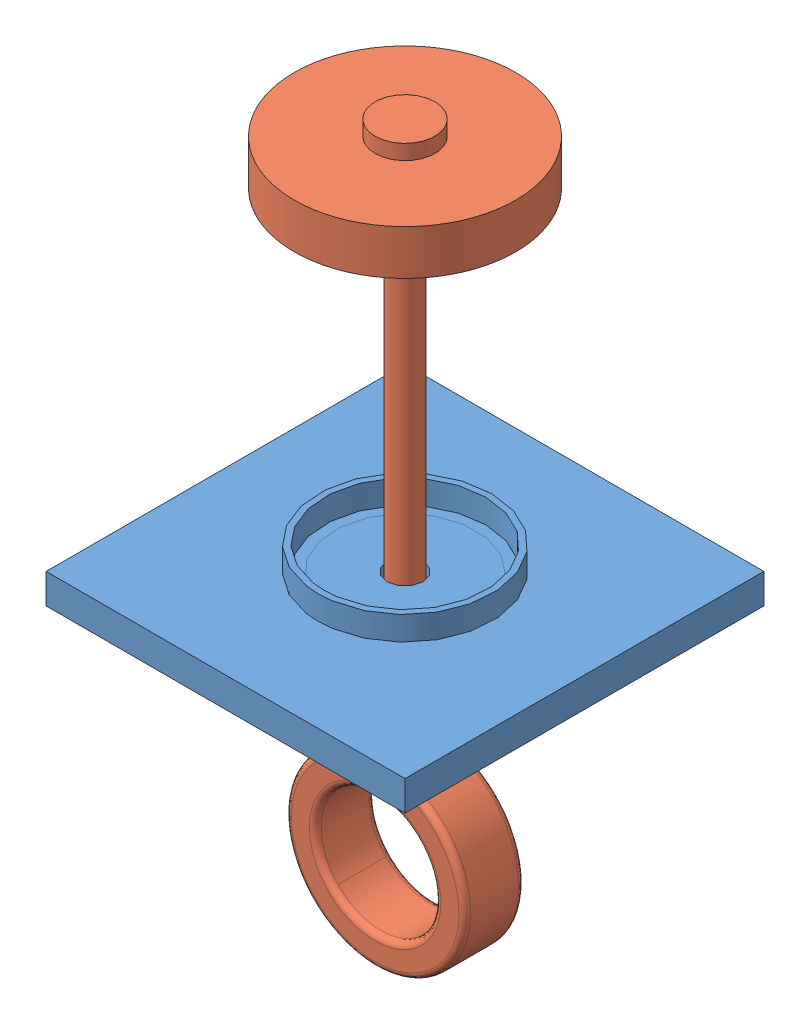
SolidWorks assembly spring sample.SLDASM, configuration No Spring (file format 3400). Lengths in mm.
Overall size (152.4 306.07 152.4).
3 component instances, 3 part files, 7 mates.
Components (placement in the parent):
- base plate-1: base plate.SLDPRT [Default] at origin
- plunger-1: plunger.SLDPRT [Default] at (0 -88.9 0) x (1 0 0) z (0 0 -1)
- spring-1: spring.SLDPRT [Default] at (0 167.64 0) x (1 0 0) z (0 0 -1) (suppressed, hidden)
Mates (geometry in assembly coordinates):
- Concentric1: concentric aligned: cylinder of base plate-1; cylinder of plunger-1
- Parallel1: parallel aligned: plane of base plate-1 through (-76.2 12.7 76.2) normal (0 0 1); plane of plunger-1 through (0 -88.9 12.7) normal (0 0 1)
- Distance1: distance = 152.4 mm anti-aligned: plane of base plate-1 through (-76.2 12.7 76.2) normal (0 1 0); plane of plunger-1 through (0 165.1 -43.18) normal (0 -1 0)
- Coincident3: coincident anti-aligned: plane of base plate-1 through (-76.2 12.7 76.2) normal (0 1 0); plane of spring-1 through (-63.5 12.7 45.8073) normal (0 -1 0)
- Parallel2: parallel anti-aligned: plane of spring-1 through (-63.5 165.1 45.8073) normal (0 1 0); plane of plunger-1 through (0 165.1 -43.18) normal (0 -1 0)
- Concentric2: concentric aligned: cylinder of ?; circle of spring-1
- Parallel3: parallel aligned: plane of base plate-1 through (-76.2 12.7 -76.2) normal (0 0 -1); plane of spring-1 through (45.0584 27.432 11.3163) normal (0 0 -1)
